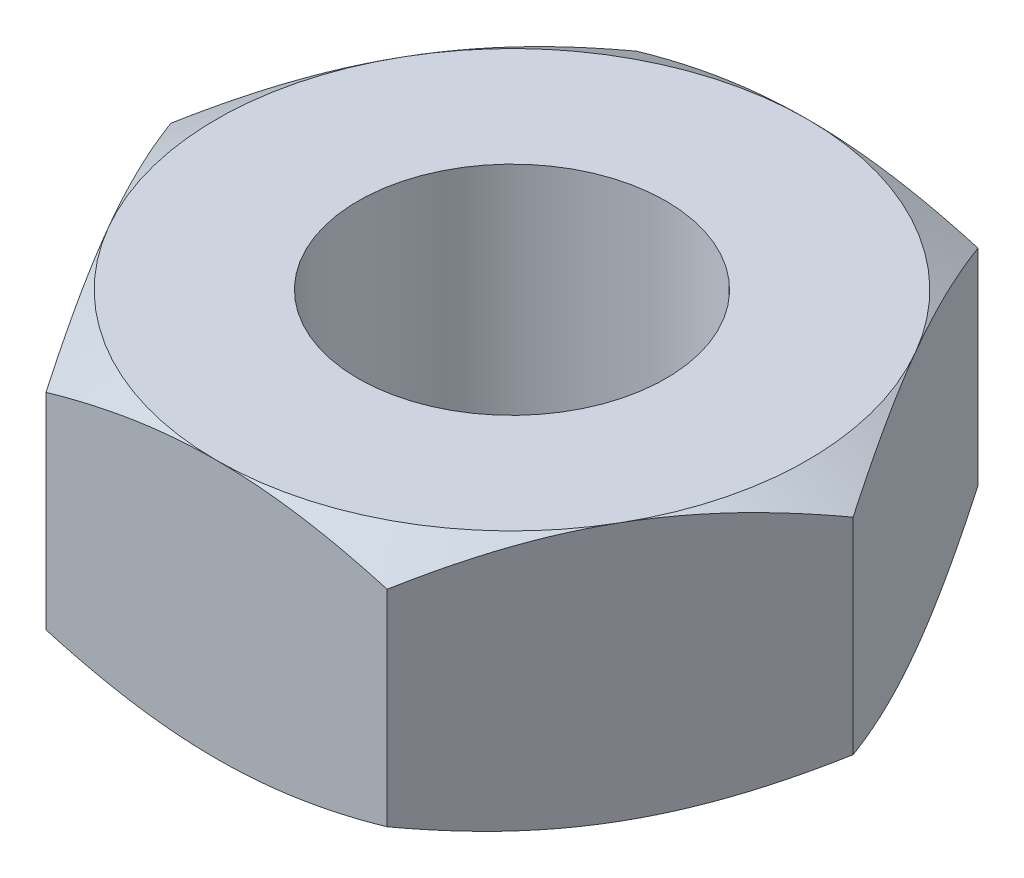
ISO-10303-21;
HEADER;
FILE_DESCRIPTION(('STEP AP214'),'2;1');
FILE_NAME('part.step','',(''),(''),'','','');
FILE_SCHEMA(('AUTOMOTIVE_DESIGN { 1 0 10303 214 1 1 1 1 }'));
ENDSEC;
DATA;
#1=APPLICATION_CONTEXT('core data for automotive mechanical design processes');
#2=APPLICATION_PROTOCOL_DEFINITION('international standard','automotive_design',2000,#1);
#3=PRODUCT_CONTEXT('',#1,'mechanical');
#4=PRODUCT('Part','Part','',(#3));
#5=PRODUCT_RELATED_PRODUCT_CATEGORY('part','',(#4));
#6=PRODUCT_DEFINITION_FORMATION('','',#4);
#7=PRODUCT_DEFINITION_CONTEXT('part definition',#1,'design');
#8=PRODUCT_DEFINITION('design','',#6,#7);
#9=PRODUCT_DEFINITION_SHAPE('','',#8);
#10=(LENGTH_UNIT() NAMED_UNIT(*) SI_UNIT(.MILLI.,.METRE.));
#11=(NAMED_UNIT(*) PLANE_ANGLE_UNIT() SI_UNIT($,.RADIAN.));
#12=(NAMED_UNIT(*) SI_UNIT($,.STERADIAN.) SOLID_ANGLE_UNIT());
#13=UNCERTAINTY_MEASURE_WITH_UNIT(LENGTH_MEASURE(1.E-05),#10,'distance_accuracy_value','');
#14=(GEOMETRIC_REPRESENTATION_CONTEXT(3) GLOBAL_UNCERTAINTY_ASSIGNED_CONTEXT((#13)) GLOBAL_UNIT_ASSIGNED_CONTEXT((#10,
#11,#12)) REPRESENTATION_CONTEXT('',''));
#15=CARTESIAN_POINT('',(0.,0.,0.));
#16=DIRECTION('',(0.,0.,1.));
#17=DIRECTION('',(1.,0.,0.));
#18=AXIS2_PLACEMENT_3D('',#15,#16,#17);
#19=CARTESIAN_POINT('',(2.7712812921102,4.2,4.8));
#20=DIRECTION('',(-0.866025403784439,0.,-0.5));
#21=DIRECTION('',(-0.5,0.,0.866025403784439));
#22=AXIS2_PLACEMENT_3D('',#19,#20,#21);
#23=PLANE('',#22);
#24=CARTESIAN_POINT('',(5.54267805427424,0.42878537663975,-0.0002));
#25=CARTESIAN_POINT('',(5.42088870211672,0.358453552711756,0.210745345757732));
#26=CARTESIAN_POINT('',(5.29805768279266,0.294483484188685,0.423494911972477));
#27=CARTESIAN_POINT('',(5.05026871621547,0.182823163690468,0.852677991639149));
#28=CARTESIAN_POINT('',(4.92530636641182,0.135172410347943,1.06911913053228));
#29=CARTESIAN_POINT('',(4.67691129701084,0.0610099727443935,1.49935201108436));
#30=CARTESIAN_POINT('',(4.55351726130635,0.0340043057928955,1.71307675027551));
#31=CARTESIAN_POINT('',(4.36799214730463,0.00978751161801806,2.0344156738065));
#32=CARTESIAN_POINT('',(4.30610811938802,0.00442919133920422,2.14160195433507));
#33=CARTESIAN_POINT('',(4.18228287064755,-0.000765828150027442,2.35607357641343));
#34=CARTESIAN_POINT('',(4.12034165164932,-0.000602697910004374,2.46335891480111));
#35=CARTESIAN_POINT('',(3.95063941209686,0.00744316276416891,2.75729181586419));
#36=CARTESIAN_POINT('',(3.84293462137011,0.0209562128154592,2.9438419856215));
#37=CARTESIAN_POINT('',(3.62823986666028,0.0638063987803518,3.31570420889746));
#38=CARTESIAN_POINT('',(3.52125065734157,0.0931581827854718,3.50101495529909));
#39=CARTESIAN_POINT('',(3.30612333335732,0.166530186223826,3.87362641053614));
#40=CARTESIAN_POINT('',(3.19801236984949,0.210861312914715,4.06088009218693));
#41=CARTESIAN_POINT('',(2.98340277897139,0.31147536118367,4.43259480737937));
#42=CARTESIAN_POINT('',(2.87690140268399,0.367734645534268,4.61706060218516));
#43=CARTESIAN_POINT('',(2.77116582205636,0.428785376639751,4.8002));
#44=B_SPLINE_CURVE_WITH_KNOTS('',3,(#24,#25,#26,#27,#28,#29,#30,#31,#32,#33,#34,#35,#36,#37,#38,
#39,#40,#41,#42,#43),.UNSPECIFIED.,.F.,.F.,(4,2,2,2,2,2,2,2,2,4),(0.,0.760854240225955,
1.52353721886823,2.26734461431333,2.63888926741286,3.01042244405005,3.65724518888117,
4.30466716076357,4.96644900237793,5.62693149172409),.UNSPECIFIED.);
#45=CARTESIAN_POINT('',(5.5425625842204,0.428718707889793,0.));
#46=VERTEX_POINT('',#45);
#47=CARTESIAN_POINT('',(4.15692193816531,0.,2.4));
#48=VERTEX_POINT('',#47);
#49=EDGE_CURVE('E61',#46,#48,#44,.T.);
#50=ORIENTED_EDGE('',*,*,#49,.F.);
#51=DIRECTION('',(0.,-1.,0.));
#52=VECTOR('',#51,1.);
#53=CARTESIAN_POINT('',(5.5425625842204,4.2,0.));
#54=LINE('',#53,#52);
#55=CARTESIAN_POINT('',(5.5425625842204,3.77128129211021,0.));
#56=VERTEX_POINT('',#55);
#57=EDGE_CURVE('E178',#56,#46,#54,.T.);
#58=ORIENTED_EDGE('',*,*,#57,.F.);
#59=CARTESIAN_POINT('',(2.77116582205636,3.77121462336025,4.8002));
#60=CARTESIAN_POINT('',(2.89295517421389,3.84154644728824,4.58925465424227));
#61=CARTESIAN_POINT('',(3.01578619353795,3.90551651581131,4.37650508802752));
#62=CARTESIAN_POINT('',(3.26357516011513,4.01717683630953,3.94732200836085));
#63=CARTESIAN_POINT('',(3.38853750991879,4.06482758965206,3.73088086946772));
#64=CARTESIAN_POINT('',(3.63693257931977,4.13899002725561,3.30064798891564));
#65=CARTESIAN_POINT('',(3.76032661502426,4.1659956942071,3.08692324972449));
#66=CARTESIAN_POINT('',(3.94585172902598,4.19021248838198,2.7655843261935));
#67=CARTESIAN_POINT('',(4.00773575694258,4.19557080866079,2.65839804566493));
#68=CARTESIAN_POINT('',(4.13156100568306,4.20076582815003,2.44392642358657));
#69=CARTESIAN_POINT('',(4.19350222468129,4.20060269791,2.33664108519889));
#70=CARTESIAN_POINT('',(4.36320446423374,4.19255683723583,2.04270818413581));
#71=CARTESIAN_POINT('',(4.4709092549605,4.17904378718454,1.8561580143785));
#72=CARTESIAN_POINT('',(4.68560400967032,4.13619360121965,1.48429579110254));
#73=CARTESIAN_POINT('',(4.79259321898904,4.10684181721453,1.29898504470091));
#74=CARTESIAN_POINT('',(5.00772054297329,4.03346981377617,0.926373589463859));
#75=CARTESIAN_POINT('',(5.11583150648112,3.98913868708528,0.73911990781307));
#76=CARTESIAN_POINT('',(5.33044109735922,3.88852463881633,0.367405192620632));
#77=CARTESIAN_POINT('',(5.43694247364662,3.83226535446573,0.182939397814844));
#78=CARTESIAN_POINT('',(5.54267805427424,3.77121462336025,-0.000199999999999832));
#79=B_SPLINE_CURVE_WITH_KNOTS('',3,(#59,#60,#61,#62,#63,#64,#65,#66,#67,#68,#69,#70,#71,#72,#73,
#74,#75,#76,#77,#78),.UNSPECIFIED.,.F.,.F.,(4,2,2,2,2,2,2,2,2,4),(0.,0.760854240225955,
1.52353721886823,2.26734461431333,2.63888926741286,3.01042244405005,3.65724518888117,
4.30466716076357,4.96644900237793,5.62693149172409),.UNSPECIFIED.);
#80=CARTESIAN_POINT('',(4.15692193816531,4.2,2.4));
#81=VERTEX_POINT('',#80);
#82=EDGE_CURVE('E251',#81,#56,#79,.T.);
#83=ORIENTED_EDGE('',*,*,#82,.F.);
#84=CARTESIAN_POINT('',(2.7712812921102,3.7712812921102,4.8));
#85=VERTEX_POINT('',#84);
#86=EDGE_CURVE('E169',#85,#81,#79,.T.);
#87=ORIENTED_EDGE('',*,*,#86,.F.);
#88=DIRECTION('',(0.,-1.,0.));
#89=VECTOR('',#88,1.);
#90=CARTESIAN_POINT('',(2.7712812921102,4.2,4.8));
#91=LINE('',#90,#89);
#92=CARTESIAN_POINT('',(2.7712812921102,0.428718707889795,4.8));
#93=VERTEX_POINT('',#92);
#94=EDGE_CURVE('E164',#85,#93,#91,.T.);
#95=ORIENTED_EDGE('',*,*,#94,.T.);
#96=EDGE_CURVE('E156',#48,#93,#44,.T.);
#97=ORIENTED_EDGE('',*,*,#96,.F.);
#98=EDGE_LOOP('',(#50,#58,#83,#87,#95,#97));
#99=FACE_BOUND('',#98,.T.);
#100=ADVANCED_FACE('F45',(#99),#23,.F.);
#101=CARTESIAN_POINT('',(5.5425625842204,4.2,0.));
#102=DIRECTION('',(-0.866025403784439,0.,0.5));
#103=DIRECTION('',(0.5,0.,0.866025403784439));
#104=AXIS2_PLACEMENT_3D('',#101,#102,#103);
#105=PLANE('',#104);
#106=CARTESIAN_POINT('',(2.77116582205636,0.428785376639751,-4.8002));
#107=CARTESIAN_POINT('',(2.89295517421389,0.358453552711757,-4.58925465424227));
#108=CARTESIAN_POINT('',(3.01578619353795,0.294483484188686,-4.37650508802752));
#109=CARTESIAN_POINT('',(3.26357516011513,0.182823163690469,-3.94732200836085));
#110=CARTESIAN_POINT('',(3.38853750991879,0.135172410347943,-3.73088086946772));
#111=CARTESIAN_POINT('',(3.63693257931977,0.061009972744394,-3.30064798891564));
#112=CARTESIAN_POINT('',(3.76032661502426,0.0340043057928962,-3.08692324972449));
#113=CARTESIAN_POINT('',(3.94585172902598,0.00978751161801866,-2.7655843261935));
#114=CARTESIAN_POINT('',(4.00773575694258,0.00442919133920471,-2.65839804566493));
#115=CARTESIAN_POINT('',(4.13156100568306,-0.000765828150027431,-2.44392642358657));
#116=CARTESIAN_POINT('',(4.19350222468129,-0.000602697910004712,-2.33664108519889));
#117=CARTESIAN_POINT('',(4.36320446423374,0.00744316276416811,-2.04270818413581));
#118=CARTESIAN_POINT('',(4.4709092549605,0.0209562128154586,-1.8561580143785));
#119=CARTESIAN_POINT('',(4.68560400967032,0.0638063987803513,-1.48429579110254));
#120=CARTESIAN_POINT('',(4.79259321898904,0.0931581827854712,-1.29898504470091));
#121=CARTESIAN_POINT('',(5.00772054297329,0.166530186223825,-0.926373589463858));
#122=CARTESIAN_POINT('',(5.11583150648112,0.210861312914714,-0.739119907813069));
#123=CARTESIAN_POINT('',(5.33044109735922,0.31147536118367,-0.367405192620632));
#124=CARTESIAN_POINT('',(5.43694247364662,0.367734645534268,-0.182939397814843));
#125=CARTESIAN_POINT('',(5.54267805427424,0.42878537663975,0.000200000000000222));
#126=B_SPLINE_CURVE_WITH_KNOTS('',3,(#106,#107,#108,#109,#110,#111,#112,#113,#114,#115,#116,
#117,#118,#119,#120,#121,#122,#123,#124,#125),.UNSPECIFIED.,.F.,.F.,(4,2,2,2,2,2,2,2,2,4),(0.,
0.760854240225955,1.52353721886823,2.26734461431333,2.63888926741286,3.01042244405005,
3.65724518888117,4.30466716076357,4.96644900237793,5.62693149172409),.UNSPECIFIED.);
#127=CARTESIAN_POINT('',(2.7712812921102,0.428718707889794,-4.8));
#128=VERTEX_POINT('',#127);
#129=CARTESIAN_POINT('',(4.15692193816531,0.,-2.4));
#130=VERTEX_POINT('',#129);
#131=EDGE_CURVE('E68',#128,#130,#126,.T.);
#132=ORIENTED_EDGE('',*,*,#131,.F.);
#133=DIRECTION('',(0.,-1.,0.));
#134=VECTOR('',#133,1.);
#135=CARTESIAN_POINT('',(2.7712812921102,4.2,-4.8));
#136=LINE('',#135,#134);
#137=CARTESIAN_POINT('',(2.7712812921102,3.7712812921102,-4.8));
#138=VERTEX_POINT('',#137);
#139=EDGE_CURVE('E175',#138,#128,#136,.T.);
#140=ORIENTED_EDGE('',*,*,#139,.F.);
#141=CARTESIAN_POINT('',(5.54267805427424,3.77121462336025,0.000200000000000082));
#142=CARTESIAN_POINT('',(5.42088870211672,3.84154644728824,-0.210745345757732));
#143=CARTESIAN_POINT('',(5.29805768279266,3.90551651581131,-0.423494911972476));
#144=CARTESIAN_POINT('',(5.05026871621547,4.01717683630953,-0.852677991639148));
#145=CARTESIAN_POINT('',(4.92530636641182,4.06482758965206,-1.06911913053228));
#146=CARTESIAN_POINT('',(4.67691129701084,4.13899002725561,-1.49935201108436));
#147=CARTESIAN_POINT('',(4.55351726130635,4.1659956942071,-1.71307675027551));
#148=CARTESIAN_POINT('',(4.36799214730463,4.19021248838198,-2.0344156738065));
#149=CARTESIAN_POINT('',(4.30610811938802,4.1955708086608,-2.14160195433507));
#150=CARTESIAN_POINT('',(4.18228287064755,4.20076582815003,-2.35607357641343));
#151=CARTESIAN_POINT('',(4.12034165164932,4.20060269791,-2.46335891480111));
#152=CARTESIAN_POINT('',(3.95063941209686,4.19255683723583,-2.75729181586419));
#153=CARTESIAN_POINT('',(3.84293462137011,4.17904378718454,-2.9438419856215));
#154=CARTESIAN_POINT('',(3.62823986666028,4.13619360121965,-3.31570420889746));
#155=CARTESIAN_POINT('',(3.52125065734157,4.10684181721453,-3.50101495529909));
#156=CARTESIAN_POINT('',(3.30612333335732,4.03346981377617,-3.87362641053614));
#157=CARTESIAN_POINT('',(3.19801236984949,3.98913868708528,-4.06088009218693));
#158=CARTESIAN_POINT('',(2.98340277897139,3.88852463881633,-4.43259480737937));
#159=CARTESIAN_POINT('',(2.87690140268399,3.83226535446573,-4.61706060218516));
#160=CARTESIAN_POINT('',(2.77116582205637,3.77121462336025,-4.8002));
#161=B_SPLINE_CURVE_WITH_KNOTS('',3,(#141,#142,#143,#144,#145,#146,#147,#148,#149,#150,#151,
#152,#153,#154,#155,#156,#157,#158,#159,#160),.UNSPECIFIED.,.F.,.F.,(4,2,2,2,2,2,2,2,2,4),(0.,
0.760854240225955,1.52353721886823,2.26734461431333,2.63888926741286,3.01042244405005,
3.65724518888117,4.30466716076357,4.96644900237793,5.62693149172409),.UNSPECIFIED.);
#162=CARTESIAN_POINT('',(4.15692193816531,4.2,-2.4));
#163=VERTEX_POINT('',#162);
#164=EDGE_CURVE('E313',#163,#138,#161,.T.);
#165=ORIENTED_EDGE('',*,*,#164,.F.);
#166=EDGE_CURVE('E318',#56,#163,#161,.T.);
#167=ORIENTED_EDGE('',*,*,#166,.F.);
#168=ORIENTED_EDGE('',*,*,#57,.T.);
#169=EDGE_CURVE('E295',#130,#46,#126,.T.);
#170=ORIENTED_EDGE('',*,*,#169,.F.);
#171=EDGE_LOOP('',(#132,#140,#165,#167,#168,#170));
#172=FACE_BOUND('',#171,.T.);
#173=ADVANCED_FACE('F306',(#172),#105,.F.);
#174=CARTESIAN_POINT('',(2.7712812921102,4.2,-4.8));
#175=DIRECTION('',(0.,0.,1.));
#176=DIRECTION('',(1.,0.,0.));
#177=AXIS2_PLACEMENT_3D('',#174,#175,#176);
#178=PLANE('',#177);
#179=CARTESIAN_POINT('',(-7.58419451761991,2.4107391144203,-4.8));
#180=CARTESIAN_POINT('',(-7.37330580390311,2.30788329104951,-4.8));
#181=CARTESIAN_POINT('',(-7.16194772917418,2.20597403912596,-4.8));
#182=CARTESIAN_POINT('',(-6.7380437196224,2.0045784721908,-4.8));
#183=CARTESIAN_POINT('',(-6.52549761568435,1.90509251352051,-4.8));
#184=CARTESIAN_POINT('',(-6.09793932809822,1.70860251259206,-4.8));
#185=CARTESIAN_POINT('',(-5.8829200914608,1.61161376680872,-4.8));
#186=CARTESIAN_POINT('',(-5.45121949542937,1.42142314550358,-4.8));
#187=CARTESIAN_POINT('',(-5.23453821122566,1.32822109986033,-4.8));
#188=CARTESIAN_POINT('',(-4.79170856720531,1.14348685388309,-4.8));
#189=CARTESIAN_POINT('',(-4.56549028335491,1.05212139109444,-4.8));
#190=CARTESIAN_POINT('',(-4.11045944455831,0.875972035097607,-4.8));
#191=CARTESIAN_POINT('',(-3.8816466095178,0.791188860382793,-4.8));
#192=CARTESIAN_POINT('',(-3.42144724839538,0.630327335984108,-4.8));
#193=CARTESIAN_POINT('',(-3.19006653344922,0.55423252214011,-4.8));
#194=CARTESIAN_POINT('',(-2.72398888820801,0.413096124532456,-4.8));
#195=CARTESIAN_POINT('',(-2.48929298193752,0.348051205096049,-4.8));
#196=CARTESIAN_POINT('',(-2.01775667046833,0.232389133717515,-4.8));
#197=CARTESIAN_POINT('',(-1.78093666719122,0.181690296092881,-4.8));
#198=CARTESIAN_POINT('',(-1.30421047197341,0.0974917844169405,-4.8));
#199=CARTESIAN_POINT('',(-1.064304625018,0.0639902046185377,-4.8));
#200=CARTESIAN_POINT('',(-0.585793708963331,0.0172896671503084,-4.8));
#201=CARTESIAN_POINT('',(-0.347215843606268,0.00381886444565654,-4.8));
#202=CARTESIAN_POINT('',(0.13023657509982,-0.00240333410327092,-4.8));
#203=CARTESIAN_POINT('',(0.369111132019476,0.00484552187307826,-4.8));
#204=CARTESIAN_POINT('',(0.770556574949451,0.0339138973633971,-4.8));
#205=CARTESIAN_POINT('',(0.933537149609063,0.0504441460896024,-4.8));
#206=CARTESIAN_POINT('',(1.2583886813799,0.0921944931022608,-4.8));
#207=CARTESIAN_POINT('',(1.42025950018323,0.117415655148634,-4.8));
#208=CARTESIAN_POINT('',(1.90394062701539,0.20479835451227,-4.8));
#209=CARTESIAN_POINT('',(2.22366419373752,0.2786662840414,-4.8));
#210=CARTESIAN_POINT('',(2.70203175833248,0.407840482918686,-4.8));
#211=CARTESIAN_POINT('',(2.86312371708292,0.45460703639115,-4.8));
#212=CARTESIAN_POINT('',(3.18374548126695,0.553266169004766,-4.8));
#213=CARTESIAN_POINT('',(3.34327527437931,0.605158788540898,-4.8));
#214=CARTESIAN_POINT('',(3.66082010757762,0.713215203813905,-4.8));
#215=CARTESIAN_POINT('',(3.81883554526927,0.769377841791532,-4.8));
#216=CARTESIAN_POINT('',(4.13353768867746,0.885286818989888,-4.8));
#217=CARTESIAN_POINT('',(4.29022442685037,0.945033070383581,-4.8));
#218=CARTESIAN_POINT('',(4.71813346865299,1.11291323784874,-4.8));
#219=CARTESIAN_POINT('',(4.98816235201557,1.22408645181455,-4.8));
#220=CARTESIAN_POINT('',(5.52537425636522,1.45313303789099,-4.8));
#221=CARTESIAN_POINT('',(5.79255693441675,1.57100720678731,-4.8));
#222=CARTESIAN_POINT('',(6.32474351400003,1.81184280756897,-4.8));
#223=CARTESIAN_POINT('',(6.58974647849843,1.93480630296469,-4.8));
#224=CARTESIAN_POINT('',(7.11791163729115,2.1845821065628,-4.8));
#225=CARTESIAN_POINT('',(7.38107391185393,2.31139424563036,-4.8));
#226=CARTESIAN_POINT('',(7.90637213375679,2.56823114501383,-4.8));
#227=CARTESIAN_POINT('',(8.16850560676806,2.69826095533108,-4.8));
#228=CARTESIAN_POINT('',(8.69157892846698,2.96070091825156,-4.8));
#229=CARTESIAN_POINT('',(8.95251876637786,3.09311109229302,-4.8));
#230=CARTESIAN_POINT('',(9.73376273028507,3.49311116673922,-4.8));
#231=CARTESIAN_POINT('',(10.2526164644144,3.76353242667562,-4.8));
#232=CARTESIAN_POINT('',(11.2314809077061,4.27975337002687,-4.8));
#233=CARTESIAN_POINT('',(11.6917642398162,4.52503863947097,-4.8));
#234=CARTESIAN_POINT('',(12.6107980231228,5.01853515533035,-4.8));
#235=CARTESIAN_POINT('',(13.0695483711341,5.26674659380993,-4.8));
#236=CARTESIAN_POINT('',(13.9842755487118,5.76445914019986,-4.8));
#237=CARTESIAN_POINT('',(14.4402564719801,6.01395273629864,-4.8));
#238=CARTESIAN_POINT('',(15.3512623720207,6.51459048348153,-4.8));
#239=CARTESIAN_POINT('',(15.8062874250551,6.76573449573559,-4.8));
#240=CARTESIAN_POINT('',(16.2609785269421,7.01747795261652,-4.8));
#241=B_SPLINE_CURVE_WITH_KNOTS('',3,(#179,#180,#181,#182,#183,#184,#185,#186,#187,#188,#189,
#190,#191,#192,#193,#194,#195,#196,#197,#198,#199,#200,#201,#202,#203,#204,#205,#206,#207,#208,
#209,#210,#211,#212,#213,#214,#215,#216,#217,#218,#219,#220,#221,#222,#223,#224,#225,#226,#227,
#228,#229,#230,#231,#232,#233,#234,#235,#236,#237,#238,#239,#240),.UNSPECIFIED.,.F.,.F.,(4,2,2,
2,2,2,2,2,2,2,2,2,2,2,2,2,2,2,2,2,2,2,2,2,2,2,2,2,2,2,4),(0.,0.703911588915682,1.40792606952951,
2.11554130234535,2.82312470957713,3.55496160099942,4.28687826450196,5.01738410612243,
5.74766903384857,6.47370801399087,7.19966651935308,7.91567987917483,8.63170194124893,
9.12291650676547,9.61419121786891,10.5972063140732,11.1003888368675,11.6035753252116,
12.1066258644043,12.6096640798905,13.485584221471,14.3616087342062,15.237991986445,
16.1143367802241,16.9921572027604,17.8699855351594,19.6252234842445,21.1898951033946,
22.7546700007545,24.3139902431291,25.8731809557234),.UNSPECIFIED.);
#242=CARTESIAN_POINT('',(-2.7712812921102,0.428718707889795,-4.8));
#243=VERTEX_POINT('',#242);
#244=CARTESIAN_POINT('',(0.,0.,-4.8));
#245=VERTEX_POINT('',#244);
#246=EDGE_CURVE('E327',#243,#245,#241,.T.);
#247=ORIENTED_EDGE('',*,*,#246,.F.);
#248=DIRECTION('',(0.,-1.,0.));
#249=VECTOR('',#248,1.);
#250=CARTESIAN_POINT('',(-2.7712812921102,4.2,-4.8));
#251=LINE('',#250,#249);
#252=CARTESIAN_POINT('',(-2.7712812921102,3.7712812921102,-4.8));
#253=VERTEX_POINT('',#252);
#254=EDGE_CURVE('E166',#253,#243,#251,.T.);
#255=ORIENTED_EDGE('',*,*,#254,.F.);
#256=CARTESIAN_POINT('',(-7.58419451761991,1.7892608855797,-4.8));
#257=CARTESIAN_POINT('',(-7.37330580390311,1.89211670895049,-4.8));
#258=CARTESIAN_POINT('',(-7.16194772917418,1.99402596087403,-4.8));
#259=CARTESIAN_POINT('',(-6.7380437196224,2.1954215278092,-4.8));
#260=CARTESIAN_POINT('',(-6.52549761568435,2.29490748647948,-4.8));
#261=CARTESIAN_POINT('',(-6.09793932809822,2.49139748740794,-4.8));
#262=CARTESIAN_POINT('',(-5.8829200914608,2.58838623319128,-4.8));
#263=CARTESIAN_POINT('',(-5.45121949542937,2.77857685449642,-4.8));
#264=CARTESIAN_POINT('',(-5.23453821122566,2.87177890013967,-4.8));
#265=CARTESIAN_POINT('',(-4.79170856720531,3.05651314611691,-4.8));
#266=CARTESIAN_POINT('',(-4.56549028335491,3.14787860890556,-4.8));
#267=CARTESIAN_POINT('',(-4.11045944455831,3.32402796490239,-4.8));
#268=CARTESIAN_POINT('',(-3.88164660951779,3.40881113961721,-4.8));
#269=CARTESIAN_POINT('',(-3.42144724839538,3.56967266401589,-4.8));
#270=CARTESIAN_POINT('',(-3.19006653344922,3.64576747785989,-4.8));
#271=CARTESIAN_POINT('',(-2.72398888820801,3.78690387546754,-4.8));
#272=CARTESIAN_POINT('',(-2.48929298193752,3.85194879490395,-4.8));
#273=CARTESIAN_POINT('',(-2.01775667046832,3.96761086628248,-4.8));
#274=CARTESIAN_POINT('',(-1.78093666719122,4.01830970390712,-4.8));
#275=CARTESIAN_POINT('',(-1.30421047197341,4.10250821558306,-4.8));
#276=CARTESIAN_POINT('',(-1.064304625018,4.13600979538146,-4.8));
#277=CARTESIAN_POINT('',(-0.585793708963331,4.18271033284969,-4.8));
#278=CARTESIAN_POINT('',(-0.347215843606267,4.19618113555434,-4.8));
#279=CARTESIAN_POINT('',(0.13023657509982,4.20240333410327,-4.8));
#280=CARTESIAN_POINT('',(0.369111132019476,4.19515447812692,-4.8));
#281=CARTESIAN_POINT('',(0.77055657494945,4.1660861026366,-4.8));
#282=CARTESIAN_POINT('',(0.933537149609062,4.1495558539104,-4.8));
#283=CARTESIAN_POINT('',(1.2583886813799,4.10780550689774,-4.8));
#284=CARTESIAN_POINT('',(1.42025950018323,4.08258434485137,-4.8));
#285=CARTESIAN_POINT('',(1.90394062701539,3.99520164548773,-4.8));
#286=CARTESIAN_POINT('',(2.22366419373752,3.9213337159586,-4.8));
#287=CARTESIAN_POINT('',(2.70203175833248,3.79215951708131,-4.8));
#288=CARTESIAN_POINT('',(2.86312371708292,3.74539296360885,-4.8));
#289=CARTESIAN_POINT('',(3.18374548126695,3.64673383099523,-4.8));
#290=CARTESIAN_POINT('',(3.34327527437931,3.5948412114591,-4.8));
#291=CARTESIAN_POINT('',(3.66082010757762,3.48678479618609,-4.8));
#292=CARTESIAN_POINT('',(3.81883554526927,3.43062215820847,-4.8));
#293=CARTESIAN_POINT('',(4.13353768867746,3.31471318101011,-4.8));
#294=CARTESIAN_POINT('',(4.29022442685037,3.25496692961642,-4.8));
#295=CARTESIAN_POINT('',(4.71813346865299,3.08708676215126,-4.8));
#296=CARTESIAN_POINT('',(4.98816235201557,2.97591354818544,-4.8));
#297=CARTESIAN_POINT('',(5.52537425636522,2.74686696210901,-4.8));
#298=CARTESIAN_POINT('',(5.79255693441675,2.62899279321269,-4.8));
#299=CARTESIAN_POINT('',(6.32474351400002,2.38815719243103,-4.8));
#300=CARTESIAN_POINT('',(6.58974647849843,2.26519369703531,-4.8));
#301=CARTESIAN_POINT('',(7.11791163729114,2.0154178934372,-4.8));
#302=CARTESIAN_POINT('',(7.38107391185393,1.88860575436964,-4.8));
#303=CARTESIAN_POINT('',(7.90637213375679,1.63176885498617,-4.8));
#304=CARTESIAN_POINT('',(8.16850560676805,1.50173904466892,-4.8));
#305=CARTESIAN_POINT('',(8.69157892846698,1.23929908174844,-4.8));
#306=CARTESIAN_POINT('',(8.95251876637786,1.10688890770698,-4.8));
#307=CARTESIAN_POINT('',(9.73376273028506,0.706888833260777,-4.8));
#308=CARTESIAN_POINT('',(10.2526164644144,0.436467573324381,-4.8));
#309=CARTESIAN_POINT('',(11.2314809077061,-0.0797533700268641,-4.8));
#310=CARTESIAN_POINT('',(11.6917642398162,-0.325038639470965,-4.8));
#311=CARTESIAN_POINT('',(12.6107980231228,-0.818535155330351,-4.8));
#312=CARTESIAN_POINT('',(13.0695483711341,-1.06674659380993,-4.8));
#313=CARTESIAN_POINT('',(13.9842755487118,-1.56445914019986,-4.8));
#314=CARTESIAN_POINT('',(14.4402564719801,-1.81395273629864,-4.8));
#315=CARTESIAN_POINT('',(15.3512623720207,-2.31459048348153,-4.8));
#316=CARTESIAN_POINT('',(15.8062874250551,-2.56573449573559,-4.8));
#317=CARTESIAN_POINT('',(16.2609785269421,-2.81747795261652,-4.8));
#318=B_SPLINE_CURVE_WITH_KNOTS('',3,(#256,#257,#258,#259,#260,#261,#262,#263,#264,#265,#266,
#267,#268,#269,#270,#271,#272,#273,#274,#275,#276,#277,#278,#279,#280,#281,#282,#283,#284,#285,
#286,#287,#288,#289,#290,#291,#292,#293,#294,#295,#296,#297,#298,#299,#300,#301,#302,#303,#304,
#305,#306,#307,#308,#309,#310,#311,#312,#313,#314,#315,#316,#317),.UNSPECIFIED.,.F.,.F.,(4,2,2,
2,2,2,2,2,2,2,2,2,2,2,2,2,2,2,2,2,2,2,2,2,2,2,2,2,2,2,4),(0.,0.703911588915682,1.40792606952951,
2.11554130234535,2.82312470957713,3.55496160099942,4.28687826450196,5.01738410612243,
5.74766903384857,6.47370801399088,7.19966651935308,7.91567987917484,8.63170194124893,
9.12291650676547,9.61419121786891,10.5972063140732,11.1003888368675,11.6035753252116,
12.1066258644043,12.6096640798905,13.485584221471,14.3616087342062,15.237991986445,
16.1143367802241,16.9921572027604,17.8699855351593,19.6252234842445,21.1898951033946,
22.7546700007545,24.3139902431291,25.8731809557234),.UNSPECIFIED.);
#319=CARTESIAN_POINT('',(0.,4.2,-4.8));
#320=VERTEX_POINT('',#319);
#321=EDGE_CURVE('E214',#320,#253,#318,.F.);
#322=ORIENTED_EDGE('',*,*,#321,.F.);
#323=EDGE_CURVE('E319',#138,#320,#318,.F.);
#324=ORIENTED_EDGE('',*,*,#323,.F.);
#325=ORIENTED_EDGE('',*,*,#139,.T.);
#326=EDGE_CURVE('E301',#245,#128,#241,.T.);
#327=ORIENTED_EDGE('',*,*,#326,.F.);
#328=EDGE_LOOP('',(#247,#255,#322,#324,#325,#327));
#329=FACE_BOUND('',#328,.T.);
#330=ADVANCED_FACE('F309',(#329),#178,.F.);
#331=CARTESIAN_POINT('',(-2.7712812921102,4.2,-4.8));
#332=DIRECTION('',(0.866025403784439,0.,0.5));
#333=DIRECTION('',(0.5,0.,-0.866025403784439));
#334=AXIS2_PLACEMENT_3D('',#331,#332,#333);
#335=PLANE('',#334);
#336=CARTESIAN_POINT('',(-5.54267805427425,0.428785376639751,0.000200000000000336));
#337=CARTESIAN_POINT('',(-5.42088870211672,0.358453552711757,-0.210745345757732));
#338=CARTESIAN_POINT('',(-5.29805768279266,0.294483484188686,-0.423494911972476));
#339=CARTESIAN_POINT('',(-5.05026871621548,0.182823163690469,-0.852677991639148));
#340=CARTESIAN_POINT('',(-4.92530636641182,0.135172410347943,-1.06911913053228));
#341=CARTESIAN_POINT('',(-4.67691129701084,0.0610099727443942,-1.49935201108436));
#342=CARTESIAN_POINT('',(-4.55351726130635,0.0340043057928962,-1.71307675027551));
#343=CARTESIAN_POINT('',(-4.36799214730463,0.00978751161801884,-2.0344156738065));
#344=CARTESIAN_POINT('',(-4.30610811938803,0.00442919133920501,-2.14160195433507));
#345=CARTESIAN_POINT('',(-4.18228287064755,-0.000765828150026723,-2.35607357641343));
#346=CARTESIAN_POINT('',(-4.12034165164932,-0.00060269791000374,-2.46335891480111));
#347=CARTESIAN_POINT('',(-3.95063941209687,0.00744316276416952,-2.75729181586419));
#348=CARTESIAN_POINT('',(-3.84293462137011,0.02095621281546,-2.9438419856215));
#349=CARTESIAN_POINT('',(-3.62823986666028,0.0638063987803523,-3.31570420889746));
#350=CARTESIAN_POINT('',(-3.52125065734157,0.0931581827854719,-3.50101495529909));
#351=CARTESIAN_POINT('',(-3.30612333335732,0.166530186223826,-3.87362641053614));
#352=CARTESIAN_POINT('',(-3.19801236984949,0.210861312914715,-4.06088009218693));
#353=CARTESIAN_POINT('',(-2.98340277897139,0.311475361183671,-4.43259480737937));
#354=CARTESIAN_POINT('',(-2.87690140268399,0.367734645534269,-4.61706060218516));
#355=CARTESIAN_POINT('',(-2.77116582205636,0.428785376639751,-4.8002));
#356=B_SPLINE_CURVE_WITH_KNOTS('',3,(#336,#337,#338,#339,#340,#341,#342,#343,#344,#345,#346,
#347,#348,#349,#350,#351,#352,#353,#354,#355),.UNSPECIFIED.,.F.,.F.,(4,2,2,2,2,2,2,2,2,4),(0.,
0.760854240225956,1.52353721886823,2.26734461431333,2.63888926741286,3.01042244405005,
3.65724518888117,4.30466716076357,4.96644900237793,5.6269314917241),.UNSPECIFIED.);
#357=CARTESIAN_POINT('',(-5.54256258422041,0.428718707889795,0.));
#358=VERTEX_POINT('',#357);
#359=CARTESIAN_POINT('',(-4.1569219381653,0.,-2.4));
#360=VERTEX_POINT('',#359);
#361=EDGE_CURVE('E289',#358,#360,#356,.T.);
#362=ORIENTED_EDGE('',*,*,#361,.F.);
#363=DIRECTION('',(0.,-1.,0.));
#364=VECTOR('',#363,1.);
#365=CARTESIAN_POINT('',(-5.54256258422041,4.2,0.));
#366=LINE('',#365,#364);
#367=CARTESIAN_POINT('',(-5.54256258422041,3.7712812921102,0.));
#368=VERTEX_POINT('',#367);
#369=EDGE_CURVE('E163',#368,#358,#366,.T.);
#370=ORIENTED_EDGE('',*,*,#369,.F.);
#371=CARTESIAN_POINT('',(-2.77116582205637,3.77121462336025,-4.8002));
#372=CARTESIAN_POINT('',(-2.89295517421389,3.84154644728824,-4.58925465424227));
#373=CARTESIAN_POINT('',(-3.01578619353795,3.90551651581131,-4.37650508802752));
#374=CARTESIAN_POINT('',(-3.26357516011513,4.01717683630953,-3.94732200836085));
#375=CARTESIAN_POINT('',(-3.38853750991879,4.06482758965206,-3.73088086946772));
#376=CARTESIAN_POINT('',(-3.63693257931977,4.1389900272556,-3.30064798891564));
#377=CARTESIAN_POINT('',(-3.76032661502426,4.1659956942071,-3.08692324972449));
#378=CARTESIAN_POINT('',(-3.94585172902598,4.19021248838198,-2.7655843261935));
#379=CARTESIAN_POINT('',(-4.00773575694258,4.19557080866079,-2.65839804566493));
#380=CARTESIAN_POINT('',(-4.13156100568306,4.20076582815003,-2.44392642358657));
#381=CARTESIAN_POINT('',(-4.19350222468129,4.20060269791,-2.33664108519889));
#382=CARTESIAN_POINT('',(-4.36320446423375,4.19255683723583,-2.04270818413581));
#383=CARTESIAN_POINT('',(-4.4709092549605,4.17904378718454,-1.8561580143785));
#384=CARTESIAN_POINT('',(-4.68560400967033,4.13619360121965,-1.48429579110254));
#385=CARTESIAN_POINT('',(-4.79259321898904,4.10684181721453,-1.29898504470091));
#386=CARTESIAN_POINT('',(-5.00772054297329,4.03346981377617,-0.926373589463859));
#387=CARTESIAN_POINT('',(-5.11583150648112,3.98913868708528,-0.73911990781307));
#388=CARTESIAN_POINT('',(-5.33044109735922,3.88852463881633,-0.367405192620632));
#389=CARTESIAN_POINT('',(-5.43694247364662,3.83226535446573,-0.182939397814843));
#390=CARTESIAN_POINT('',(-5.54267805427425,3.77121462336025,0.000200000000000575));
#391=B_SPLINE_CURVE_WITH_KNOTS('',3,(#371,#372,#373,#374,#375,#376,#377,#378,#379,#380,#381,
#382,#383,#384,#385,#386,#387,#388,#389,#390),.UNSPECIFIED.,.F.,.F.,(4,2,2,2,2,2,2,2,2,4),(0.,
0.760854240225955,1.52353721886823,2.26734461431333,2.63888926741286,3.01042244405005,
3.65724518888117,4.30466716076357,4.96644900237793,5.6269314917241),.UNSPECIFIED.);
#392=CARTESIAN_POINT('',(-4.1569219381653,4.2,-2.4));
#393=VERTEX_POINT('',#392);
#394=EDGE_CURVE('E205',#393,#368,#391,.T.);
#395=ORIENTED_EDGE('',*,*,#394,.F.);
#396=EDGE_CURVE('E208',#253,#393,#391,.T.);
#397=ORIENTED_EDGE('',*,*,#396,.F.);
#398=ORIENTED_EDGE('',*,*,#254,.T.);
#399=EDGE_CURVE('E296',#360,#243,#356,.T.);
#400=ORIENTED_EDGE('',*,*,#399,.F.);
#401=EDGE_LOOP('',(#362,#370,#395,#397,#398,#400));
#402=FACE_BOUND('',#401,.T.);
#403=ADVANCED_FACE('F207',(#402),#335,.F.);
#404=CARTESIAN_POINT('',(-5.54256258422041,4.2,0.));
#405=DIRECTION('',(0.866025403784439,0.,-0.5));
#406=DIRECTION('',(-0.5,0.,-0.866025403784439));
#407=AXIS2_PLACEMENT_3D('',#404,#405,#406);
#408=PLANE('',#407);
#409=CARTESIAN_POINT('',(-2.77116582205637,0.428785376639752,4.8002));
#410=CARTESIAN_POINT('',(-2.89295517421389,0.358453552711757,4.58925465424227));
#411=CARTESIAN_POINT('',(-3.01578619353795,0.294483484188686,4.37650508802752));
#412=CARTESIAN_POINT('',(-3.26357516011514,0.182823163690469,3.94732200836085));
#413=CARTESIAN_POINT('',(-3.38853750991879,0.135172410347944,3.73088086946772));
#414=CARTESIAN_POINT('',(-3.63693257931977,0.0610099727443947,3.30064798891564));
#415=CARTESIAN_POINT('',(-3.76032661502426,0.034004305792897,3.08692324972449));
#416=CARTESIAN_POINT('',(-3.94585172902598,0.00978751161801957,2.7655843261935));
#417=CARTESIAN_POINT('',(-4.00773575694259,0.00442919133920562,2.65839804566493));
#418=CARTESIAN_POINT('',(-4.13156100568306,-0.000765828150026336,2.44392642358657));
#419=CARTESIAN_POINT('',(-4.19350222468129,-0.000602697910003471,2.33664108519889));
#420=CARTESIAN_POINT('',(-4.36320446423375,0.00744316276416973,2.04270818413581));
#421=CARTESIAN_POINT('',(-4.4709092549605,0.0209562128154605,1.8561580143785));
#422=CARTESIAN_POINT('',(-4.68560400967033,0.0638063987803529,1.48429579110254));
#423=CARTESIAN_POINT('',(-4.79259321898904,0.0931581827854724,1.29898504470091));
#424=CARTESIAN_POINT('',(-5.00772054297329,0.166530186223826,0.926373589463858));
#425=CARTESIAN_POINT('',(-5.11583150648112,0.210861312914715,0.73911990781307));
#426=CARTESIAN_POINT('',(-5.33044109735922,0.311475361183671,0.367405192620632));
#427=CARTESIAN_POINT('',(-5.43694247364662,0.367734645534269,0.182939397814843));
#428=CARTESIAN_POINT('',(-5.54267805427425,0.428785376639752,-0.000200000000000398));
#429=B_SPLINE_CURVE_WITH_KNOTS('',3,(#409,#410,#411,#412,#413,#414,#415,#416,#417,#418,#419,
#420,#421,#422,#423,#424,#425,#426,#427,#428),.UNSPECIFIED.,.F.,.F.,(4,2,2,2,2,2,2,2,2,4),(0.,
0.760854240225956,1.52353721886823,2.26734461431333,2.63888926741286,3.01042244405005,
3.65724518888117,4.30466716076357,4.96644900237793,5.6269314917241),.UNSPECIFIED.);
#430=CARTESIAN_POINT('',(-2.77128129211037,0.428718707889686,4.8));
#431=VERTEX_POINT('',#430);
#432=CARTESIAN_POINT('',(-4.1569219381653,0.,2.4));
#433=VERTEX_POINT('',#432);
#434=EDGE_CURVE('E139',#431,#433,#429,.T.);
#435=ORIENTED_EDGE('',*,*,#434,.F.);
#436=DIRECTION('',(0.,-1.,0.));
#437=VECTOR('',#436,1.);
#438=CARTESIAN_POINT('',(-2.7712812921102,4.2,4.8));
#439=LINE('',#438,#437);
#440=CARTESIAN_POINT('',(-2.77128129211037,3.77128129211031,4.8));
#441=VERTEX_POINT('',#440);
#442=EDGE_CURVE('E153',#441,#431,#439,.T.);
#443=ORIENTED_EDGE('',*,*,#442,.F.);
#444=CARTESIAN_POINT('',(-5.54267805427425,3.77121462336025,-0.000200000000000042));
#445=CARTESIAN_POINT('',(-5.42088870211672,3.84154644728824,0.210745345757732));
#446=CARTESIAN_POINT('',(-5.29805768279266,3.90551651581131,0.423494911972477));
#447=CARTESIAN_POINT('',(-5.05026871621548,4.01717683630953,0.852677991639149));
#448=CARTESIAN_POINT('',(-4.92530636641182,4.06482758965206,1.06911913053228));
#449=CARTESIAN_POINT('',(-4.67691129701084,4.1389900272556,1.49935201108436));
#450=CARTESIAN_POINT('',(-4.55351726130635,4.1659956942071,1.71307675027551));
#451=CARTESIAN_POINT('',(-4.36799214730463,4.19021248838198,2.0344156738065));
#452=CARTESIAN_POINT('',(-4.30610811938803,4.19557080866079,2.14160195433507));
#453=CARTESIAN_POINT('',(-4.18228287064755,4.20076582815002,2.35607357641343));
#454=CARTESIAN_POINT('',(-4.12034165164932,4.20060269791,2.46335891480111));
#455=CARTESIAN_POINT('',(-3.95063941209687,4.19255683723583,2.75729181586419));
#456=CARTESIAN_POINT('',(-3.84293462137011,4.17904378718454,2.9438419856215));
#457=CARTESIAN_POINT('',(-3.62823986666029,4.13619360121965,3.31570420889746));
#458=CARTESIAN_POINT('',(-3.52125065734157,4.10684181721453,3.50101495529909));
#459=CARTESIAN_POINT('',(-3.30612333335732,4.03346981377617,3.87362641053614));
#460=CARTESIAN_POINT('',(-3.19801236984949,3.98913868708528,4.06088009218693));
#461=CARTESIAN_POINT('',(-2.98340277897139,3.88852463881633,4.43259480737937));
#462=CARTESIAN_POINT('',(-2.87690140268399,3.83226535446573,4.61706060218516));
#463=CARTESIAN_POINT('',(-2.77116582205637,3.77121462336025,4.8002));
#464=B_SPLINE_CURVE_WITH_KNOTS('',3,(#444,#445,#446,#447,#448,#449,#450,#451,#452,#453,#454,
#455,#456,#457,#458,#459,#460,#461,#462,#463),.UNSPECIFIED.,.F.,.F.,(4,2,2,2,2,2,2,2,2,4),(0.,
0.760854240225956,1.52353721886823,2.26734461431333,2.63888926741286,3.01042244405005,
3.65724518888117,4.30466716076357,4.96644900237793,5.62693149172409),.UNSPECIFIED.);
#465=CARTESIAN_POINT('',(-4.1569219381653,4.2,2.4));
#466=VERTEX_POINT('',#465);
#467=EDGE_CURVE('E215',#466,#441,#464,.T.);
#468=ORIENTED_EDGE('',*,*,#467,.F.);
#469=EDGE_CURVE('E212',#368,#466,#464,.T.);
#470=ORIENTED_EDGE('',*,*,#469,.F.);
#471=ORIENTED_EDGE('',*,*,#369,.T.);
#472=EDGE_CURVE('E155',#433,#358,#429,.T.);
#473=ORIENTED_EDGE('',*,*,#472,.F.);
#474=EDGE_LOOP('',(#435,#443,#468,#470,#471,#473));
#475=FACE_BOUND('',#474,.T.);
#476=ADVANCED_FACE('F151',(#475),#408,.F.);
#477=CARTESIAN_POINT('',(-2.7712812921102,4.2,4.8));
#478=DIRECTION('',(0.,0.,-1.));
#479=DIRECTION('',(-1.,0.,0.));
#480=AXIS2_PLACEMENT_3D('',#477,#478,#479);
#481=PLANE('',#480);
#482=CARTESIAN_POINT('',(-7.58419451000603,2.41073911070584,4.8));
#483=CARTESIAN_POINT('',(-7.3733057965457,2.30788328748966,4.8));
#484=CARTESIAN_POINT('',(-7.16194772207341,2.20597403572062,4.8));
#485=CARTESIAN_POINT('',(-6.73804371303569,2.00457846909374,4.8));
#486=CARTESIAN_POINT('',(-6.52549760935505,1.90509251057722,4.8));
#487=CARTESIAN_POINT('',(-6.09793932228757,1.70860250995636,4.8));
#488=CARTESIAN_POINT('',(-5.88292008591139,1.61161376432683,4.8));
#489=CARTESIAN_POINT('',(-5.4512194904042,1.42142314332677,4.8));
#490=CARTESIAN_POINT('',(-5.23453820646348,1.3282210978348,4.8));
#491=CARTESIAN_POINT('',(-4.79170856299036,1.14348685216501,4.8));
#492=CARTESIAN_POINT('',(-4.56549027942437,1.05212138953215,4.8));
#493=CARTESIAN_POINT('',(-4.11045944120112,0.875972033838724,4.8));
#494=CARTESIAN_POINT('',(-3.88164660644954,0.791188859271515,4.8));
#495=CARTESIAN_POINT('',(-3.4214472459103,0.630327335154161,4.8));
#496=CARTESIAN_POINT('',(-3.19006653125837,0.554232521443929,4.8));
#497=CARTESIAN_POINT('',(-2.72398888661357,0.41309612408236,4.8));
#498=CARTESIAN_POINT('',(-2.48929298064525,0.348051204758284,4.8));
#499=CARTESIAN_POINT('',(-2.01775666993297,0.23238913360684,4.8));
#500=CARTESIAN_POINT('',(-1.78093666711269,0.18169029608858,4.8));
#501=CARTESIAN_POINT('',(-1.30421047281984,0.0974917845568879,4.8));
#502=CARTESIAN_POINT('',(-1.06430462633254,0.0639902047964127,4.8));
#503=CARTESIAN_POINT('',(-0.585793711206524,0.0172896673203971,4.8));
#504=CARTESIAN_POINT('',(-0.347215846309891,0.00381886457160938,4.8));
#505=CARTESIAN_POINT('',(0.130236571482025,-0.00240333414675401,4.8));
#506=CARTESIAN_POINT('',(0.36911112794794,0.00484552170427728,4.8));
#507=CARTESIAN_POINT('',(0.770556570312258,0.033913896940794,4.8));
#508=CARTESIAN_POINT('',(0.933537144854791,0.050444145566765,4.8));
#509=CARTESIAN_POINT('',(1.25838867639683,0.092194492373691,4.8));
#510=CARTESIAN_POINT('',(1.42025949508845,0.117415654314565,4.8));
#511=CARTESIAN_POINT('',(1.90394062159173,0.204798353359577,4.8));
#512=CARTESIAN_POINT('',(2.22366418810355,0.278666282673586,4.8));
#513=CARTESIAN_POINT('',(2.70203175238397,0.407840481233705,4.8));
#514=CARTESIAN_POINT('',(2.86312371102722,0.45460703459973,4.8));
#515=CARTESIAN_POINT('',(3.18374547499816,0.553266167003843,4.8));
#516=CARTESIAN_POINT('',(3.34327526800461,0.605158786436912,4.8));
#517=CARTESIAN_POINT('',(3.66082010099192,0.713215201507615,4.8));
#518=CARTESIAN_POINT('',(3.81883553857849,0.769377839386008,4.8));
#519=CARTESIAN_POINT('',(4.1335376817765,0.885286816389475,4.8));
#520=CARTESIAN_POINT('',(4.29022441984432,0.945033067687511,4.8));
#521=CARTESIAN_POINT('',(4.71813346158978,1.11291323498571,4.8));
#522=CARTESIAN_POINT('',(4.988162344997,1.22408644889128,4.8));
#523=CARTESIAN_POINT('',(5.52537424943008,1.45313303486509,4.8));
#524=CARTESIAN_POINT('',(5.7925569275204,1.57100720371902,4.8));
#525=CARTESIAN_POINT('',(6.32474350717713,1.81184280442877,4.8));
#526=CARTESIAN_POINT('',(6.58974647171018,1.93480629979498,4.8));
#527=CARTESIAN_POINT('',(7.1179116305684,2.18458210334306,4.8));
#528=CARTESIAN_POINT('',(7.38107390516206,2.3113942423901,4.8));
#529=CARTESIAN_POINT('',(7.90637212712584,2.56823114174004,4.8));
#530=CARTESIAN_POINT('',(8.16850560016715,2.69826095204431,4.8));
#531=CARTESIAN_POINT('',(8.69157892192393,2.96070091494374,4.8));
#532=CARTESIAN_POINT('',(8.95251875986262,3.09311108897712,4.8));
#533=CARTESIAN_POINT('',(9.73376272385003,3.4931111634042,4.8));
#534=CARTESIAN_POINT('',(10.2526164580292,3.76353242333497,4.8));
#535=CARTESIAN_POINT('',(11.2314809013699,4.27975336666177,4.8));
#536=CARTESIAN_POINT('',(11.6917642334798,4.52503863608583,4.8));
#537=CARTESIAN_POINT('',(12.6107980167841,5.01853515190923,4.8));
#538=CARTESIAN_POINT('',(13.0695483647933,5.26674659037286,4.8));
#539=CARTESIAN_POINT('',(13.9842755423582,5.76445913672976,4.8));
#540=CARTESIAN_POINT('',(14.4402564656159,6.01395273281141,4.8));
#541=CARTESIAN_POINT('',(15.351262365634,6.51459047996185,4.8));
#542=CARTESIAN_POINT('',(15.8062874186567,6.76573449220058,4.8));
#543=CARTESIAN_POINT('',(16.2609785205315,7.01747794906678,4.8));
#544=B_SPLINE_CURVE_WITH_KNOTS('',3,(#482,#483,#484,#485,#486,#487,#488,#489,#490,#491,#492,
#493,#494,#495,#496,#497,#498,#499,#500,#501,#502,#503,#504,#505,#506,#507,#508,#509,#510,#511,
#512,#513,#514,#515,#516,#517,#518,#519,#520,#521,#522,#523,#524,#525,#526,#527,#528,#529,#530,
#531,#532,#533,#534,#535,#536,#537,#538,#539,#540,#541,#542,#543),.UNSPECIFIED.,.F.,.F.,(4,2,2,
2,2,2,2,2,2,2,2,2,2,2,2,2,2,2,2,2,2,2,2,2,2,2,2,2,2,2,4),(0.,0.703911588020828,1.40792606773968,
2.11554129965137,2.82312470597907,3.55496159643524,4.28687825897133,5.01738409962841,
5.7476690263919,6.47370800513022,7.19966650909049,7.91567986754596,8.63170192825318,
9.12291649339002,9.61419120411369,10.5972062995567,11.1003888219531,11.6035753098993,
12.1066258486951,12.6096640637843,13.4855842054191,14.3616087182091,15.2379919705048,
16.1143367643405,16.9921571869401,17.8699855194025,19.6252234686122,21.1898950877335,
22.7546699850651,24.313990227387,25.8731809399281),.UNSPECIFIED.);
#545=CARTESIAN_POINT('',(0.,0.,4.8));
#546=VERTEX_POINT('',#545);
#547=EDGE_CURVE('E145',#93,#546,#544,.F.);
#548=ORIENTED_EDGE('',*,*,#547,.F.);
#549=ORIENTED_EDGE('',*,*,#94,.F.);
#550=CARTESIAN_POINT('',(-7.58419451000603,1.78926088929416,4.8));
#551=CARTESIAN_POINT('',(-7.3733057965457,1.89211671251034,4.8));
#552=CARTESIAN_POINT('',(-7.16194772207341,1.99402596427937,4.8));
#553=CARTESIAN_POINT('',(-6.73804371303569,2.19542153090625,4.8));
#554=CARTESIAN_POINT('',(-6.52549760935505,2.29490748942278,4.8));
#555=CARTESIAN_POINT('',(-6.09793932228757,2.49139749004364,4.8));
#556=CARTESIAN_POINT('',(-5.88292008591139,2.58838623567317,4.8));
#557=CARTESIAN_POINT('',(-5.4512194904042,2.77857685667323,4.8));
#558=CARTESIAN_POINT('',(-5.23453820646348,2.8717789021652,4.8));
#559=CARTESIAN_POINT('',(-4.79170856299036,3.05651314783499,4.8));
#560=CARTESIAN_POINT('',(-4.56549027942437,3.14787861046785,4.8));
#561=CARTESIAN_POINT('',(-4.11045944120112,3.32402796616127,4.8));
#562=CARTESIAN_POINT('',(-3.88164660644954,3.40881114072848,4.8));
#563=CARTESIAN_POINT('',(-3.4214472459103,3.56967266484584,4.8));
#564=CARTESIAN_POINT('',(-3.19006653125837,3.64576747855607,4.8));
#565=CARTESIAN_POINT('',(-2.72398888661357,3.78690387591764,4.8));
#566=CARTESIAN_POINT('',(-2.48929298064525,3.85194879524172,4.8));
#567=CARTESIAN_POINT('',(-2.01775666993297,3.96761086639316,4.8));
#568=CARTESIAN_POINT('',(-1.78093666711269,4.01830970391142,4.8));
#569=CARTESIAN_POINT('',(-1.30421047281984,4.10250821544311,4.8));
#570=CARTESIAN_POINT('',(-1.06430462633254,4.13600979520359,4.8));
#571=CARTESIAN_POINT('',(-0.585793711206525,4.1827103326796,4.8));
#572=CARTESIAN_POINT('',(-0.347215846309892,4.19618113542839,4.8));
#573=CARTESIAN_POINT('',(0.130236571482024,4.20240333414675,4.8));
#574=CARTESIAN_POINT('',(0.36911112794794,4.19515447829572,4.8));
#575=CARTESIAN_POINT('',(0.770556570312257,4.16608610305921,4.8));
#576=CARTESIAN_POINT('',(0.933537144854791,4.14955585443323,4.8));
#577=CARTESIAN_POINT('',(1.25838867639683,4.10780550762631,4.8));
#578=CARTESIAN_POINT('',(1.42025949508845,4.08258434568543,4.8));
#579=CARTESIAN_POINT('',(1.90394062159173,3.99520164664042,4.8));
#580=CARTESIAN_POINT('',(2.22366418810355,3.92133371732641,4.8));
#581=CARTESIAN_POINT('',(2.70203175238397,3.79215951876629,4.8));
#582=CARTESIAN_POINT('',(2.86312371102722,3.74539296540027,4.8));
#583=CARTESIAN_POINT('',(3.18374547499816,3.64673383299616,4.8));
#584=CARTESIAN_POINT('',(3.3432752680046,3.59484121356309,4.8));
#585=CARTESIAN_POINT('',(3.66082010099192,3.48678479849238,4.8));
#586=CARTESIAN_POINT('',(3.81883553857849,3.43062216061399,4.8));
#587=CARTESIAN_POINT('',(4.1335376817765,3.31471318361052,4.8));
#588=CARTESIAN_POINT('',(4.29022441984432,3.25496693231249,4.8));
#589=CARTESIAN_POINT('',(4.71813346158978,3.08708676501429,4.8));
#590=CARTESIAN_POINT('',(4.988162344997,2.97591355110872,4.8));
#591=CARTESIAN_POINT('',(5.52537424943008,2.74686696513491,4.8));
#592=CARTESIAN_POINT('',(5.7925569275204,2.62899279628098,4.8));
#593=CARTESIAN_POINT('',(6.32474350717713,2.38815719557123,4.8));
#594=CARTESIAN_POINT('',(6.58974647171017,2.26519370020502,4.8));
#595=CARTESIAN_POINT('',(7.1179116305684,2.01541789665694,4.8));
#596=CARTESIAN_POINT('',(7.38107390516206,1.8886057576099,4.8));
#597=CARTESIAN_POINT('',(7.90637212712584,1.63176885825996,4.8));
#598=CARTESIAN_POINT('',(8.16850560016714,1.50173904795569,4.8));
#599=CARTESIAN_POINT('',(8.69157892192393,1.23929908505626,4.8));
#600=CARTESIAN_POINT('',(8.95251875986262,1.10688891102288,4.8));
#601=CARTESIAN_POINT('',(9.73376272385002,0.706888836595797,4.8));
#602=CARTESIAN_POINT('',(10.2526164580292,0.436467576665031,4.8));
#603=CARTESIAN_POINT('',(11.2314809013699,-0.0797533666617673,4.8));
#604=CARTESIAN_POINT('',(11.6917642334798,-0.325038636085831,4.8));
#605=CARTESIAN_POINT('',(12.610798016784,-0.81853515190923,4.8));
#606=CARTESIAN_POINT('',(13.0695483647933,-1.06674659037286,4.8));
#607=CARTESIAN_POINT('',(13.9842755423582,-1.56445913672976,4.8));
#608=CARTESIAN_POINT('',(14.4402564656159,-1.81395273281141,4.8));
#609=CARTESIAN_POINT('',(15.351262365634,-2.31459047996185,4.8));
#610=CARTESIAN_POINT('',(15.8062874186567,-2.56573449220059,4.8));
#611=CARTESIAN_POINT('',(16.2609785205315,-2.81747794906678,4.8));
#612=B_SPLINE_CURVE_WITH_KNOTS('',3,(#550,#551,#552,#553,#554,#555,#556,#557,#558,#559,#560,
#561,#562,#563,#564,#565,#566,#567,#568,#569,#570,#571,#572,#573,#574,#575,#576,#577,#578,#579,
#580,#581,#582,#583,#584,#585,#586,#587,#588,#589,#590,#591,#592,#593,#594,#595,#596,#597,#598,
#599,#600,#601,#602,#603,#604,#605,#606,#607,#608,#609,#610,#611),.UNSPECIFIED.,.F.,.F.,(4,2,2,
2,2,2,2,2,2,2,2,2,2,2,2,2,2,2,2,2,2,2,2,2,2,2,2,2,2,2,4),(0.,0.703911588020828,1.40792606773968,
2.11554129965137,2.82312470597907,3.55496159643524,4.28687825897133,5.01738409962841,
5.7476690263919,6.47370800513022,7.19966650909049,7.91567986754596,8.63170192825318,
9.12291649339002,9.61419120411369,10.5972062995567,11.1003888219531,11.6035753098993,
12.1066258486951,12.6096640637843,13.4855842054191,14.3616087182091,15.2379919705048,
16.1143367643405,16.9921571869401,17.8699855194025,19.6252234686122,21.1898950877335,
22.7546699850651,24.313990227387,25.8731809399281),.UNSPECIFIED.);
#613=CARTESIAN_POINT('',(0.,4.2,4.8));
#614=VERTEX_POINT('',#613);
#615=EDGE_CURVE('E258',#614,#85,#612,.T.);
#616=ORIENTED_EDGE('',*,*,#615,.F.);
#617=EDGE_CURVE('E162',#441,#614,#612,.T.);
#618=ORIENTED_EDGE('',*,*,#617,.F.);
#619=ORIENTED_EDGE('',*,*,#442,.T.);
#620=EDGE_CURVE('E136',#546,#431,#544,.F.);
#621=ORIENTED_EDGE('',*,*,#620,.F.);
#622=EDGE_LOOP('',(#548,#549,#616,#618,#619,#621));
#623=FACE_BOUND('',#622,.T.);
#624=ADVANCED_FACE('F159',(#623),#481,.F.);
#625=CARTESIAN_POINT('',(0.,4.2,0.));
#626=DIRECTION('',(0.,-1.,0.));
#627=DIRECTION('',(0.,0.,1.));
#628=AXIS2_PLACEMENT_3D('',#625,#626,#627);
#629=CONICAL_SURFACE('',#628,4.8,1.0471975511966);
#630=ORIENTED_EDGE('',*,*,#467,.T.);
#631=ORIENTED_EDGE('',*,*,#617,.T.);
#632=CARTESIAN_POINT('',(0.,4.2,0.));
#633=DIRECTION('',(0.,1.,0.));
#634=DIRECTION('',(0.,0.,1.));
#635=AXIS2_PLACEMENT_3D('',#632,#633,#634);
#636=CIRCLE('',#635,4.8);
#637=EDGE_CURVE('E180',#466,#614,#636,.T.);
#638=ORIENTED_EDGE('',*,*,#637,.F.);
#639=EDGE_LOOP('',(#630,#631,#638));
#640=FACE_BOUND('',#639,.T.);
#641=ADVANCED_FACE('F244',(#640),#629,.T.);
#642=ORIENTED_EDGE('',*,*,#394,.T.);
#643=ORIENTED_EDGE('',*,*,#469,.T.);
#644=EDGE_CURVE('E181',#393,#466,#636,.T.);
#645=ORIENTED_EDGE('',*,*,#644,.F.);
#646=EDGE_LOOP('',(#642,#643,#645));
#647=FACE_BOUND('',#646,.T.);
#648=ADVANCED_FACE('F345',(#647),#629,.T.);
#649=ORIENTED_EDGE('',*,*,#321,.T.);
#650=ORIENTED_EDGE('',*,*,#396,.T.);
#651=EDGE_CURVE('E187',#320,#393,#636,.T.);
#652=ORIENTED_EDGE('',*,*,#651,.F.);
#653=EDGE_LOOP('',(#649,#650,#652));
#654=FACE_BOUND('',#653,.T.);
#655=ADVANCED_FACE('F322',(#654),#629,.T.);
#656=ORIENTED_EDGE('',*,*,#164,.T.);
#657=ORIENTED_EDGE('',*,*,#323,.T.);
#658=EDGE_CURVE('E189',#163,#320,#636,.T.);
#659=ORIENTED_EDGE('',*,*,#658,.F.);
#660=EDGE_LOOP('',(#656,#657,#659));
#661=FACE_BOUND('',#660,.T.);
#662=ADVANCED_FACE('F339',(#661),#629,.T.);
#663=ORIENTED_EDGE('',*,*,#82,.T.);
#664=ORIENTED_EDGE('',*,*,#166,.T.);
#665=EDGE_CURVE('E182',#81,#163,#636,.T.);
#666=ORIENTED_EDGE('',*,*,#665,.F.);
#667=EDGE_LOOP('',(#663,#664,#666));
#668=FACE_BOUND('',#667,.T.);
#669=ADVANCED_FACE('F242',(#668),#629,.T.);
#670=ORIENTED_EDGE('',*,*,#86,.T.);
#671=CARTESIAN_POINT('',(0.,4.2,0.));
#672=DIRECTION('',(0.,1.,0.));
#673=DIRECTION('',(0.,0.,1.));
#674=AXIS2_PLACEMENT_3D('',#671,#672,#673);
#675=CIRCLE('',#674,4.8);
#676=EDGE_CURVE('E266',#614,#81,#675,.T.);
#677=ORIENTED_EDGE('',*,*,#676,.F.);
#678=ORIENTED_EDGE('',*,*,#615,.T.);
#679=EDGE_LOOP('',(#670,#677,#678));
#680=FACE_BOUND('',#679,.T.);
#681=ADVANCED_FACE('F237',(#680),#629,.T.);
#682=CARTESIAN_POINT('',(0.,4.2,0.));
#683=DIRECTION('',(0.,1.,0.));
#684=DIRECTION('',(0.,0.,1.));
#685=AXIS2_PLACEMENT_3D('',#682,#683,#684);
#686=PLANE('',#685);
#687=CARTESIAN_POINT('',(0.,4.2,0.));
#688=DIRECTION('',(0.,1.,0.));
#689=DIRECTION('',(0.,0.,1.));
#690=AXIS2_PLACEMENT_3D('',#687,#688,#689);
#691=CIRCLE('',#690,2.5);
#692=CARTESIAN_POINT('',(0.,4.2,2.5));
#693=VERTEX_POINT('',#692);
#694=EDGE_CURVE('E458',#693,#693,#691,.T.);
#695=ORIENTED_EDGE('',*,*,#694,.F.);
#696=EDGE_LOOP('',(#695));
#697=FACE_BOUND('',#696,.T.);
#698=ORIENTED_EDGE('',*,*,#637,.T.);
#699=ORIENTED_EDGE('',*,*,#676,.T.);
#700=ORIENTED_EDGE('',*,*,#665,.T.);
#701=ORIENTED_EDGE('',*,*,#658,.T.);
#702=ORIENTED_EDGE('',*,*,#651,.T.);
#703=ORIENTED_EDGE('',*,*,#644,.T.);
#704=EDGE_LOOP('',(#698,#699,#700,#701,#702,#703));
#705=FACE_BOUND('',#704,.T.);
#706=ADVANCED_FACE('F199',(#697,#705),#686,.T.);
#707=CARTESIAN_POINT('',(0.,0.,0.));
#708=DIRECTION('',(0.,1.,0.));
#709=DIRECTION('',(0.,0.,-1.));
#710=AXIS2_PLACEMENT_3D('',#707,#708,#709);
#711=CONICAL_SURFACE('',#710,4.8,1.0471975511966);
#712=ORIENTED_EDGE('',*,*,#434,.T.);
#713=CARTESIAN_POINT('',(0.,0.,0.));
#714=DIRECTION('',(0.,1.,0.));
#715=DIRECTION('',(0.,0.,1.));
#716=AXIS2_PLACEMENT_3D('',#713,#714,#715);
#717=CIRCLE('',#716,4.8);
#718=EDGE_CURVE('E49',#433,#546,#717,.T.);
#719=ORIENTED_EDGE('',*,*,#718,.T.);
#720=ORIENTED_EDGE('',*,*,#620,.T.);
#721=EDGE_LOOP('',(#712,#719,#720));
#722=FACE_BOUND('',#721,.T.);
#723=ADVANCED_FACE('F138',(#722),#711,.T.);
#724=ORIENTED_EDGE('',*,*,#361,.T.);
#725=EDGE_CURVE('E193',#360,#433,#717,.T.);
#726=ORIENTED_EDGE('',*,*,#725,.T.);
#727=ORIENTED_EDGE('',*,*,#472,.T.);
#728=EDGE_LOOP('',(#724,#726,#727));
#729=FACE_BOUND('',#728,.T.);
#730=ADVANCED_FACE('F381',(#729),#711,.T.);
#731=ORIENTED_EDGE('',*,*,#246,.T.);
#732=EDGE_CURVE('E467',#245,#360,#717,.T.);
#733=ORIENTED_EDGE('',*,*,#732,.T.);
#734=ORIENTED_EDGE('',*,*,#399,.T.);
#735=EDGE_LOOP('',(#731,#733,#734));
#736=FACE_BOUND('',#735,.T.);
#737=ADVANCED_FACE('F245',(#736),#711,.T.);
#738=ORIENTED_EDGE('',*,*,#326,.T.);
#739=ORIENTED_EDGE('',*,*,#131,.T.);
#740=CARTESIAN_POINT('',(0.,0.,0.));
#741=DIRECTION('',(0.,-1.,0.));
#742=DIRECTION('',(0.,0.,-1.));
#743=AXIS2_PLACEMENT_3D('',#740,#741,#742);
#744=CIRCLE('',#743,4.8);
#745=EDGE_CURVE('E146',#245,#130,#744,.T.);
#746=ORIENTED_EDGE('',*,*,#745,.F.);
#747=EDGE_LOOP('',(#738,#739,#746));
#748=FACE_BOUND('',#747,.T.);
#749=ADVANCED_FACE('F395',(#748),#711,.T.);
#750=ORIENTED_EDGE('',*,*,#169,.T.);
#751=ORIENTED_EDGE('',*,*,#49,.T.);
#752=EDGE_CURVE('E54',#48,#130,#717,.T.);
#753=ORIENTED_EDGE('',*,*,#752,.T.);
#754=EDGE_LOOP('',(#750,#751,#753));
#755=FACE_BOUND('',#754,.T.);
#756=ADVANCED_FACE('F389',(#755),#711,.T.);
#757=ORIENTED_EDGE('',*,*,#96,.T.);
#758=ORIENTED_EDGE('',*,*,#547,.T.);
#759=EDGE_CURVE('E12',#546,#48,#717,.T.);
#760=ORIENTED_EDGE('',*,*,#759,.T.);
#761=EDGE_LOOP('',(#757,#758,#760));
#762=FACE_BOUND('',#761,.T.);
#763=ADVANCED_FACE('F382',(#762),#711,.T.);
#764=CARTESIAN_POINT('',(0.,0.,0.));
#765=DIRECTION('',(0.,1.,0.));
#766=DIRECTION('',(0.,0.,1.));
#767=AXIS2_PLACEMENT_3D('',#764,#765,#766);
#768=PLANE('',#767);
#769=CARTESIAN_POINT('',(0.,0.,0.));
#770=DIRECTION('',(0.,1.,0.));
#771=DIRECTION('',(0.,0.,1.));
#772=AXIS2_PLACEMENT_3D('',#769,#770,#771);
#773=CIRCLE('',#772,2.5);
#774=CARTESIAN_POINT('',(0.,0.,2.5));
#775=VERTEX_POINT('',#774);
#776=EDGE_CURVE('E455',#775,#775,#773,.T.);
#777=ORIENTED_EDGE('',*,*,#776,.T.);
#778=EDGE_LOOP('',(#777));
#779=FACE_BOUND('',#778,.T.);
#780=ORIENTED_EDGE('',*,*,#759,.F.);
#781=ORIENTED_EDGE('',*,*,#718,.F.);
#782=ORIENTED_EDGE('',*,*,#725,.F.);
#783=ORIENTED_EDGE('',*,*,#732,.F.);
#784=ORIENTED_EDGE('',*,*,#745,.T.);
#785=ORIENTED_EDGE('',*,*,#752,.F.);
#786=EDGE_LOOP('',(#780,#781,#782,#783,#784,#785));
#787=FACE_BOUND('',#786,.T.);
#788=ADVANCED_FACE('F270',(#779,#787),#768,.F.);
#789=CARTESIAN_POINT('',(0.,4.2,0.));
#790=DIRECTION('',(0.,1.,0.));
#791=DIRECTION('',(0.,0.,1.));
#792=AXIS2_PLACEMENT_3D('',#789,#790,#791);
#793=CYLINDRICAL_SURFACE('',#792,2.5);
#794=ORIENTED_EDGE('',*,*,#776,.F.);
#795=EDGE_LOOP('',(#794));
#796=FACE_BOUND('',#795,.T.);
#797=ORIENTED_EDGE('',*,*,#694,.T.);
#798=EDGE_LOOP('',(#797));
#799=FACE_BOUND('',#798,.T.);
#800=ADVANCED_FACE('F424',(#796,#799),#793,.F.);
#801=CLOSED_SHELL('',(#100,#173,#330,#403,#476,#624,#641,#648,#655,#662,#669,#681,#706,#723,
#730,#737,#749,#756,#763,#788,#800));
#802=MANIFOLD_SOLID_BREP('B2',#801);
#803=ADVANCED_BREP_SHAPE_REPRESENTATION('',(#18,#802),#14);
#804=SHAPE_DEFINITION_REPRESENTATION(#9,#803);
ENDSEC;
END-ISO-10303-21;
